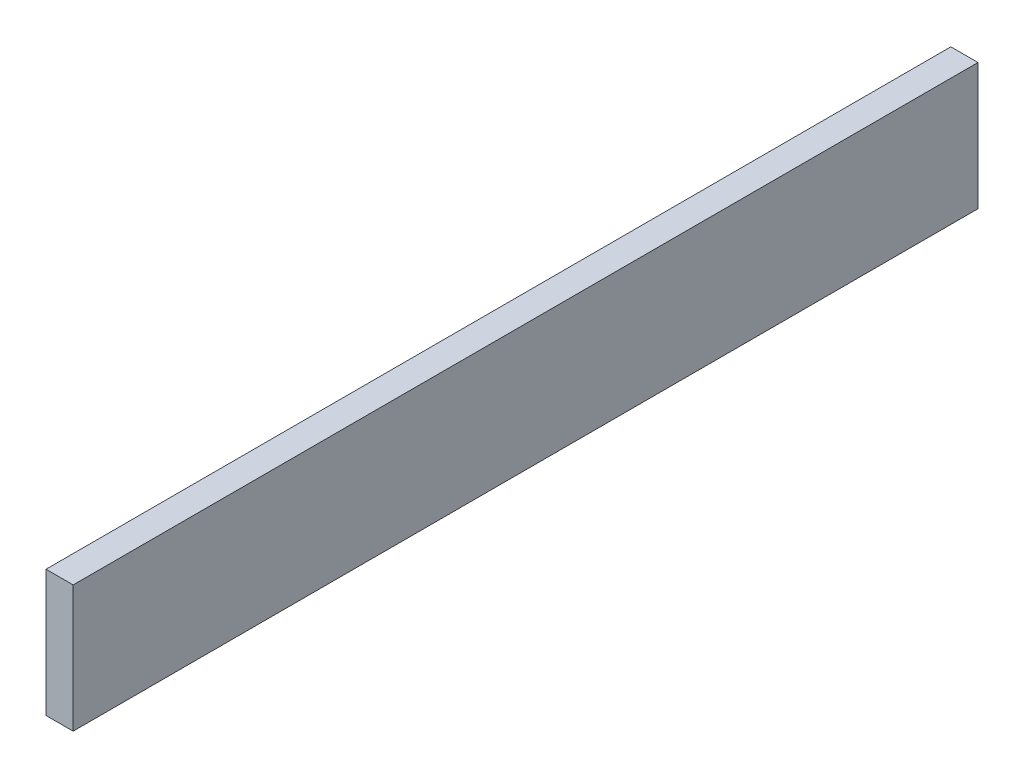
from build123d import *

# Parameters (mm, degrees)
SKETCH1_W           = 19.05
SKETCH1_H           = 88.9
BOSS_EXTRUDE1_DEPTH = 635


with BuildPart() as part:
    # Sketch1 → Boss-Extrude1 (new body)
    with BuildSketch(Plane.XY):
        Rectangle(SKETCH1_W, SKETCH1_H)
    extrude(amount=BOSS_EXTRUDE1_DEPTH)


solid = part.part
